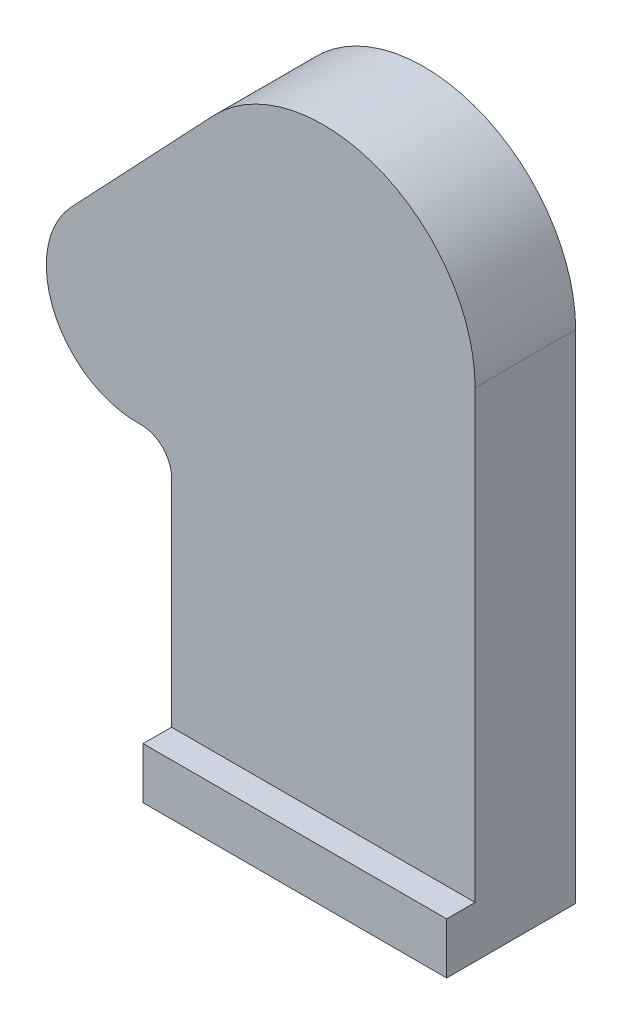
ISO-10303-21;
HEADER;
FILE_DESCRIPTION(('STEP AP214'),'2;1');
FILE_NAME('part.step','',(''),(''),'','','');
FILE_SCHEMA(('AUTOMOTIVE_DESIGN { 1 0 10303 214 1 1 1 1 }'));
ENDSEC;
DATA;
#1=APPLICATION_CONTEXT('core data for automotive mechanical design processes');
#2=APPLICATION_PROTOCOL_DEFINITION('international standard','automotive_design',2000,#1);
#3=PRODUCT_CONTEXT('',#1,'mechanical');
#4=PRODUCT('Part','Part','',(#3));
#5=PRODUCT_RELATED_PRODUCT_CATEGORY('part','',(#4));
#6=PRODUCT_DEFINITION_FORMATION('','',#4);
#7=PRODUCT_DEFINITION_CONTEXT('part definition',#1,'design');
#8=PRODUCT_DEFINITION('design','',#6,#7);
#9=PRODUCT_DEFINITION_SHAPE('','',#8);
#10=(LENGTH_UNIT() NAMED_UNIT(*) SI_UNIT(.MILLI.,.METRE.));
#11=(NAMED_UNIT(*) PLANE_ANGLE_UNIT() SI_UNIT($,.RADIAN.));
#12=(NAMED_UNIT(*) SI_UNIT($,.STERADIAN.) SOLID_ANGLE_UNIT());
#13=UNCERTAINTY_MEASURE_WITH_UNIT(LENGTH_MEASURE(1.E-05),#10,'distance_accuracy_value','');
#14=(GEOMETRIC_REPRESENTATION_CONTEXT(3) GLOBAL_UNCERTAINTY_ASSIGNED_CONTEXT((#13)) GLOBAL_UNIT_ASSIGNED_CONTEXT((#10,
#11,#12)) REPRESENTATION_CONTEXT('',''));
#15=CARTESIAN_POINT('',(0.,0.,0.));
#16=DIRECTION('',(0.,0.,1.));
#17=DIRECTION('',(1.,0.,0.));
#18=AXIS2_PLACEMENT_3D('',#15,#16,#17);
#19=CARTESIAN_POINT('',(0.,0.,53.));
#20=DIRECTION('',(0.,0.,-1.));
#21=DIRECTION('',(-1.,0.,0.));
#22=AXIS2_PLACEMENT_3D('',#19,#20,#21);
#23=PLANE('',#22);
#24=DIRECTION('',(-1.,0.,0.));
#25=VECTOR('',#24,1.);
#26=CARTESIAN_POINT('',(-80.,-235.,53.));
#27=LINE('',#26,#25);
#28=CARTESIAN_POINT('',(80.,-235.,53.));
#29=VERTEX_POINT('',#28);
#30=CARTESIAN_POINT('',(-80.,-235.,53.));
#31=VERTEX_POINT('',#30);
#32=EDGE_CURVE('E48',#29,#31,#27,.T.);
#33=ORIENTED_EDGE('',*,*,#32,.F.);
#34=DIRECTION('',(0.,1.,0.));
#35=VECTOR('',#34,1.);
#36=CARTESIAN_POINT('',(80.,0.,53.));
#37=LINE('',#36,#35);
#38=CARTESIAN_POINT('',(80.,0.,53.));
#39=VERTEX_POINT('',#38);
#40=EDGE_CURVE('E151',#29,#39,#37,.T.);
#41=ORIENTED_EDGE('',*,*,#40,.T.);
#42=CARTESIAN_POINT('',(0.,0.,53.));
#43=DIRECTION('',(0.,0.,1.));
#44=DIRECTION('',(-1.,0.,0.));
#45=AXIS2_PLACEMENT_3D('',#42,#43,#44);
#46=CIRCLE('',#45,80.);
#47=CARTESIAN_POINT('',(-58.1055863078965,54.9885518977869,53.));
#48=VERTEX_POINT('',#47);
#49=EDGE_CURVE('E154',#39,#48,#46,.T.);
#50=ORIENTED_EDGE('',*,*,#49,.T.);
#51=DIRECTION('',(-0.687356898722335,-0.726319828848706,0.));
#52=VECTOR('',#51,1.);
#53=CARTESIAN_POINT('',(-132.863351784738,-24.0068688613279,53.));
#54=LINE('',#53,#52);
#55=CARTESIAN_POINT('',(-132.863351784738,-24.0068688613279,53.));
#56=VERTEX_POINT('',#55);
#57=EDGE_CURVE('E175',#48,#56,#54,.T.);
#58=ORIENTED_EDGE('',*,*,#57,.T.);
#59=CARTESIAN_POINT('',(-98.,-57.,53.));
#60=DIRECTION('',(0.,0.,1.));
#61=DIRECTION('',(-1.,0.,0.));
#62=AXIS2_PLACEMENT_3D('',#59,#60,#61);
#63=CIRCLE('',#62,48.);
#64=CARTESIAN_POINT('',(-96.5,-104.976556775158,53.));
#65=VERTEX_POINT('',#64);
#66=EDGE_CURVE('E174',#56,#65,#63,.T.);
#67=ORIENTED_EDGE('',*,*,#66,.T.);
#68=CARTESIAN_POINT('',(-96.,-120.968742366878,53.));
#69=DIRECTION('',(0.,0.,-1.));
#70=DIRECTION('',(1.,0.,0.));
#71=AXIS2_PLACEMENT_3D('',#68,#69,#70);
#72=CIRCLE('',#71,16.);
#73=CARTESIAN_POINT('',(-80.,-120.968742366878,53.));
#74=VERTEX_POINT('',#73);
#75=EDGE_CURVE('E54',#65,#74,#72,.T.);
#76=ORIENTED_EDGE('',*,*,#75,.T.);
#77=DIRECTION('',(0.,-1.,0.));
#78=VECTOR('',#77,1.);
#79=CARTESIAN_POINT('',(-80.,-120.968742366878,53.));
#80=LINE('',#79,#78);
#81=EDGE_CURVE('E101',#74,#31,#80,.T.);
#82=ORIENTED_EDGE('',*,*,#81,.T.);
#83=EDGE_LOOP('',(#33,#41,#50,#58,#67,#76,#82));
#84=FACE_BOUND('',#83,.T.);
#85=ADVANCED_FACE('F31',(#84),#23,.F.);
#86=CARTESIAN_POINT('',(-80.,-262.,53.));
#87=DIRECTION('',(0.,1.,0.));
#88=DIRECTION('',(0.,0.,1.));
#89=AXIS2_PLACEMENT_3D('',#86,#87,#88);
#90=PLANE('',#89);
#91=DIRECTION('',(1.,0.,0.));
#92=VECTOR('',#91,1.);
#93=CARTESIAN_POINT('',(-80.,-262.,0.));
#94=LINE('',#93,#92);
#95=CARTESIAN_POINT('',(-80.,-262.,0.));
#96=VERTEX_POINT('',#95);
#97=CARTESIAN_POINT('',(80.,-262.,0.));
#98=VERTEX_POINT('',#97);
#99=EDGE_CURVE('E122',#96,#98,#94,.T.);
#100=ORIENTED_EDGE('',*,*,#99,.T.);
#101=DIRECTION('',(0.,0.,-1.));
#102=VECTOR('',#101,1.);
#103=CARTESIAN_POINT('',(80.,-262.,53.));
#104=LINE('',#103,#102);
#105=CARTESIAN_POINT('',(80.,-262.,68.));
#106=VERTEX_POINT('',#105);
#107=EDGE_CURVE('E11',#106,#98,#104,.T.);
#108=ORIENTED_EDGE('',*,*,#107,.F.);
#109=DIRECTION('',(1.,0.,0.));
#110=VECTOR('',#109,1.);
#111=CARTESIAN_POINT('',(-80.,-262.,68.));
#112=LINE('',#111,#110);
#113=CARTESIAN_POINT('',(-80.,-262.,68.));
#114=VERTEX_POINT('',#113);
#115=EDGE_CURVE('E133',#114,#106,#112,.T.);
#116=ORIENTED_EDGE('',*,*,#115,.F.);
#117=DIRECTION('',(0.,0.,-1.));
#118=VECTOR('',#117,1.);
#119=CARTESIAN_POINT('',(-80.,-262.,53.));
#120=LINE('',#119,#118);
#121=EDGE_CURVE('E105',#114,#96,#120,.T.);
#122=ORIENTED_EDGE('',*,*,#121,.T.);
#123=EDGE_LOOP('',(#100,#108,#116,#122));
#124=FACE_BOUND('',#123,.T.);
#125=ADVANCED_FACE('F33',(#124),#90,.F.);
#126=CARTESIAN_POINT('',(80.,0.,53.));
#127=DIRECTION('',(-1.,0.,0.));
#128=DIRECTION('',(0.,-1.,0.));
#129=AXIS2_PLACEMENT_3D('',#126,#127,#128);
#130=PLANE('',#129);
#131=DIRECTION('',(0.,1.,0.));
#132=VECTOR('',#131,1.);
#133=CARTESIAN_POINT('',(80.,0.,0.));
#134=LINE('',#133,#132);
#135=CARTESIAN_POINT('',(80.,0.,0.));
#136=VERTEX_POINT('',#135);
#137=EDGE_CURVE('E139',#98,#136,#134,.T.);
#138=ORIENTED_EDGE('',*,*,#137,.T.);
#139=DIRECTION('',(0.,0.,-1.));
#140=VECTOR('',#139,1.);
#141=CARTESIAN_POINT('',(80.,0.,53.));
#142=LINE('',#141,#140);
#143=EDGE_CURVE('E40',#39,#136,#142,.T.);
#144=ORIENTED_EDGE('',*,*,#143,.F.);
#145=ORIENTED_EDGE('',*,*,#40,.F.);
#146=DIRECTION('',(0.,0.,-1.));
#147=VECTOR('',#146,1.);
#148=CARTESIAN_POINT('',(80.,-235.,68.));
#149=LINE('',#148,#147);
#150=CARTESIAN_POINT('',(80.,-235.,68.));
#151=VERTEX_POINT('',#150);
#152=EDGE_CURVE('E115',#151,#29,#149,.T.);
#153=ORIENTED_EDGE('',*,*,#152,.F.);
#154=DIRECTION('',(0.,1.,0.));
#155=VECTOR('',#154,1.);
#156=CARTESIAN_POINT('',(80.,-262.,68.));
#157=LINE('',#156,#155);
#158=EDGE_CURVE('E123',#106,#151,#157,.T.);
#159=ORIENTED_EDGE('',*,*,#158,.F.);
#160=ORIENTED_EDGE('',*,*,#107,.T.);
#161=EDGE_LOOP('',(#138,#144,#145,#153,#159,#160));
#162=FACE_BOUND('',#161,.T.);
#163=ADVANCED_FACE('F205',(#162),#130,.F.);
#164=CARTESIAN_POINT('',(0.,0.,53.));
#165=DIRECTION('',(0.,0.,-1.));
#166=DIRECTION('',(-1.,0.,0.));
#167=AXIS2_PLACEMENT_3D('',#164,#165,#166);
#168=CYLINDRICAL_SURFACE('',#167,80.);
#169=CARTESIAN_POINT('',(0.,0.,0.));
#170=DIRECTION('',(0.,0.,1.));
#171=DIRECTION('',(-1.,0.,0.));
#172=AXIS2_PLACEMENT_3D('',#169,#170,#171);
#173=CIRCLE('',#172,80.);
#174=CARTESIAN_POINT('',(-58.1055863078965,54.9885518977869,0.));
#175=VERTEX_POINT('',#174);
#176=EDGE_CURVE('E141',#136,#175,#173,.T.);
#177=ORIENTED_EDGE('',*,*,#176,.T.);
#178=DIRECTION('',(0.,0.,-1.));
#179=VECTOR('',#178,1.);
#180=CARTESIAN_POINT('',(-58.1055863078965,54.9885518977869,53.));
#181=LINE('',#180,#179);
#182=EDGE_CURVE('E159',#48,#175,#181,.T.);
#183=ORIENTED_EDGE('',*,*,#182,.F.);
#184=ORIENTED_EDGE('',*,*,#49,.F.);
#185=ORIENTED_EDGE('',*,*,#143,.T.);
#186=EDGE_LOOP('',(#177,#183,#184,#185));
#187=FACE_BOUND('',#186,.T.);
#188=ADVANCED_FACE('F182',(#187),#168,.T.);
#189=CARTESIAN_POINT('',(-132.863351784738,-24.0068688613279,53.));
#190=DIRECTION('',(0.726319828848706,-0.687356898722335,0.));
#191=DIRECTION('',(0.687356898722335,0.726319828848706,0.));
#192=AXIS2_PLACEMENT_3D('',#189,#190,#191);
#193=PLANE('',#192);
#194=DIRECTION('',(-0.687356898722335,-0.726319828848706,0.));
#195=VECTOR('',#194,1.);
#196=CARTESIAN_POINT('',(-132.863351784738,-24.0068688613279,0.));
#197=LINE('',#196,#195);
#198=CARTESIAN_POINT('',(-132.863351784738,-24.0068688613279,0.));
#199=VERTEX_POINT('',#198);
#200=EDGE_CURVE('E143',#175,#199,#197,.T.);
#201=ORIENTED_EDGE('',*,*,#200,.T.);
#202=DIRECTION('',(0.,0.,-1.));
#203=VECTOR('',#202,1.);
#204=CARTESIAN_POINT('',(-132.863351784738,-24.0068688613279,53.));
#205=LINE('',#204,#203);
#206=EDGE_CURVE('E162',#56,#199,#205,.T.);
#207=ORIENTED_EDGE('',*,*,#206,.F.);
#208=ORIENTED_EDGE('',*,*,#57,.F.);
#209=ORIENTED_EDGE('',*,*,#182,.T.);
#210=EDGE_LOOP('',(#201,#207,#208,#209));
#211=FACE_BOUND('',#210,.T.);
#212=ADVANCED_FACE('F186',(#211),#193,.F.);
#213=CARTESIAN_POINT('',(-98.,-57.,53.));
#214=DIRECTION('',(0.,0.,-1.));
#215=DIRECTION('',(-1.,0.,0.));
#216=AXIS2_PLACEMENT_3D('',#213,#214,#215);
#217=CYLINDRICAL_SURFACE('',#216,48.);
#218=CARTESIAN_POINT('',(-98.,-57.,0.));
#219=DIRECTION('',(0.,0.,1.));
#220=DIRECTION('',(-1.,0.,0.));
#221=AXIS2_PLACEMENT_3D('',#218,#219,#220);
#222=CIRCLE('',#221,48.);
#223=CARTESIAN_POINT('',(-96.5,-104.976556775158,0.));
#224=VERTEX_POINT('',#223);
#225=EDGE_CURVE('E145',#199,#224,#222,.T.);
#226=ORIENTED_EDGE('',*,*,#225,.T.);
#227=DIRECTION('',(0.,0.,-1.));
#228=VECTOR('',#227,1.);
#229=CARTESIAN_POINT('',(-96.5,-104.976556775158,53.));
#230=LINE('',#229,#228);
#231=EDGE_CURVE('E165',#65,#224,#230,.T.);
#232=ORIENTED_EDGE('',*,*,#231,.F.);
#233=ORIENTED_EDGE('',*,*,#66,.F.);
#234=ORIENTED_EDGE('',*,*,#206,.T.);
#235=EDGE_LOOP('',(#226,#232,#233,#234));
#236=FACE_BOUND('',#235,.T.);
#237=ADVANCED_FACE('F191',(#236),#217,.T.);
#238=CARTESIAN_POINT('',(-96.,-120.968742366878,53.));
#239=DIRECTION('',(0.,0.,-1.));
#240=DIRECTION('',(-1.,0.,0.));
#241=AXIS2_PLACEMENT_3D('',#238,#239,#240);
#242=CYLINDRICAL_SURFACE('',#241,16.);
#243=CARTESIAN_POINT('',(-96.,-120.968742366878,0.));
#244=DIRECTION('',(0.,0.,-1.));
#245=DIRECTION('',(1.,0.,0.));
#246=AXIS2_PLACEMENT_3D('',#243,#244,#245);
#247=CIRCLE('',#246,16.);
#248=CARTESIAN_POINT('',(-80.,-120.968742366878,0.));
#249=VERTEX_POINT('',#248);
#250=EDGE_CURVE('E147',#224,#249,#247,.T.);
#251=ORIENTED_EDGE('',*,*,#250,.T.);
#252=DIRECTION('',(0.,0.,-1.));
#253=VECTOR('',#252,1.);
#254=CARTESIAN_POINT('',(-80.,-120.968742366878,53.));
#255=LINE('',#254,#253);
#256=EDGE_CURVE('E168',#74,#249,#255,.T.);
#257=ORIENTED_EDGE('',*,*,#256,.F.);
#258=ORIENTED_EDGE('',*,*,#75,.F.);
#259=ORIENTED_EDGE('',*,*,#231,.T.);
#260=EDGE_LOOP('',(#251,#257,#258,#259));
#261=FACE_BOUND('',#260,.T.);
#262=ADVANCED_FACE('F194',(#261),#242,.F.);
#263=CARTESIAN_POINT('',(-80.,-120.968742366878,53.));
#264=DIRECTION('',(1.,0.,0.));
#265=DIRECTION('',(0.,1.,0.));
#266=AXIS2_PLACEMENT_3D('',#263,#264,#265);
#267=PLANE('',#266);
#268=DIRECTION('',(0.,-1.,0.));
#269=VECTOR('',#268,1.);
#270=CARTESIAN_POINT('',(-80.,-120.968742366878,0.));
#271=LINE('',#270,#269);
#272=EDGE_CURVE('E149',#249,#96,#271,.T.);
#273=ORIENTED_EDGE('',*,*,#272,.T.);
#274=ORIENTED_EDGE('',*,*,#121,.F.);
#275=DIRECTION('',(0.,-1.,0.));
#276=VECTOR('',#275,1.);
#277=CARTESIAN_POINT('',(-80.,-262.,68.));
#278=LINE('',#277,#276);
#279=CARTESIAN_POINT('',(-80.,-235.,68.));
#280=VERTEX_POINT('',#279);
#281=EDGE_CURVE('E116',#280,#114,#278,.T.);
#282=ORIENTED_EDGE('',*,*,#281,.F.);
#283=DIRECTION('',(0.,0.,-1.));
#284=VECTOR('',#283,1.);
#285=CARTESIAN_POINT('',(-80.,-235.,68.));
#286=LINE('',#285,#284);
#287=EDGE_CURVE('E112',#280,#31,#286,.T.);
#288=ORIENTED_EDGE('',*,*,#287,.T.);
#289=ORIENTED_EDGE('',*,*,#81,.F.);
#290=ORIENTED_EDGE('',*,*,#256,.T.);
#291=EDGE_LOOP('',(#273,#274,#282,#288,#289,#290));
#292=FACE_BOUND('',#291,.T.);
#293=ADVANCED_FACE('F118',(#292),#267,.F.);
#294=CARTESIAN_POINT('',(0.,0.,0.));
#295=DIRECTION('',(0.,0.,-1.));
#296=DIRECTION('',(-1.,0.,0.));
#297=AXIS2_PLACEMENT_3D('',#294,#295,#296);
#298=PLANE('',#297);
#299=ORIENTED_EDGE('',*,*,#99,.F.);
#300=ORIENTED_EDGE('',*,*,#272,.F.);
#301=ORIENTED_EDGE('',*,*,#250,.F.);
#302=ORIENTED_EDGE('',*,*,#225,.F.);
#303=ORIENTED_EDGE('',*,*,#200,.F.);
#304=ORIENTED_EDGE('',*,*,#176,.F.);
#305=ORIENTED_EDGE('',*,*,#137,.F.);
#306=EDGE_LOOP('',(#299,#300,#301,#302,#303,#304,#305));
#307=FACE_BOUND('',#306,.T.);
#308=ADVANCED_FACE('F198',(#307),#298,.T.);
#309=CARTESIAN_POINT('',(-80.,-235.,68.));
#310=DIRECTION('',(0.,-1.,0.));
#311=DIRECTION('',(0.,0.,-1.));
#312=AXIS2_PLACEMENT_3D('',#309,#310,#311);
#313=PLANE('',#312);
#314=ORIENTED_EDGE('',*,*,#32,.T.);
#315=ORIENTED_EDGE('',*,*,#287,.F.);
#316=DIRECTION('',(-1.,0.,0.));
#317=VECTOR('',#316,1.);
#318=CARTESIAN_POINT('',(-80.,-235.,68.));
#319=LINE('',#318,#317);
#320=EDGE_CURVE('E120',#151,#280,#319,.T.);
#321=ORIENTED_EDGE('',*,*,#320,.F.);
#322=ORIENTED_EDGE('',*,*,#152,.T.);
#323=EDGE_LOOP('',(#314,#315,#321,#322));
#324=FACE_BOUND('',#323,.T.);
#325=ADVANCED_FACE('F110',(#324),#313,.F.);
#326=CARTESIAN_POINT('',(-80.,-235.,68.));
#327=DIRECTION('',(0.,0.,-1.));
#328=DIRECTION('',(-1.,0.,0.));
#329=AXIS2_PLACEMENT_3D('',#326,#327,#328);
#330=PLANE('',#329);
#331=ORIENTED_EDGE('',*,*,#281,.T.);
#332=ORIENTED_EDGE('',*,*,#115,.T.);
#333=ORIENTED_EDGE('',*,*,#158,.T.);
#334=ORIENTED_EDGE('',*,*,#320,.T.);
#335=EDGE_LOOP('',(#331,#332,#333,#334));
#336=FACE_BOUND('',#335,.T.);
#337=ADVANCED_FACE('F203',(#336),#330,.F.);
#338=CLOSED_SHELL('',(#85,#125,#163,#188,#212,#237,#262,#293,#308,#325,#337));
#339=MANIFOLD_SOLID_BREP('B2',#338);
#340=ADVANCED_BREP_SHAPE_REPRESENTATION('',(#18,#339),#14);
#341=SHAPE_DEFINITION_REPRESENTATION(#9,#340);
ENDSEC;
END-ISO-10303-21;
